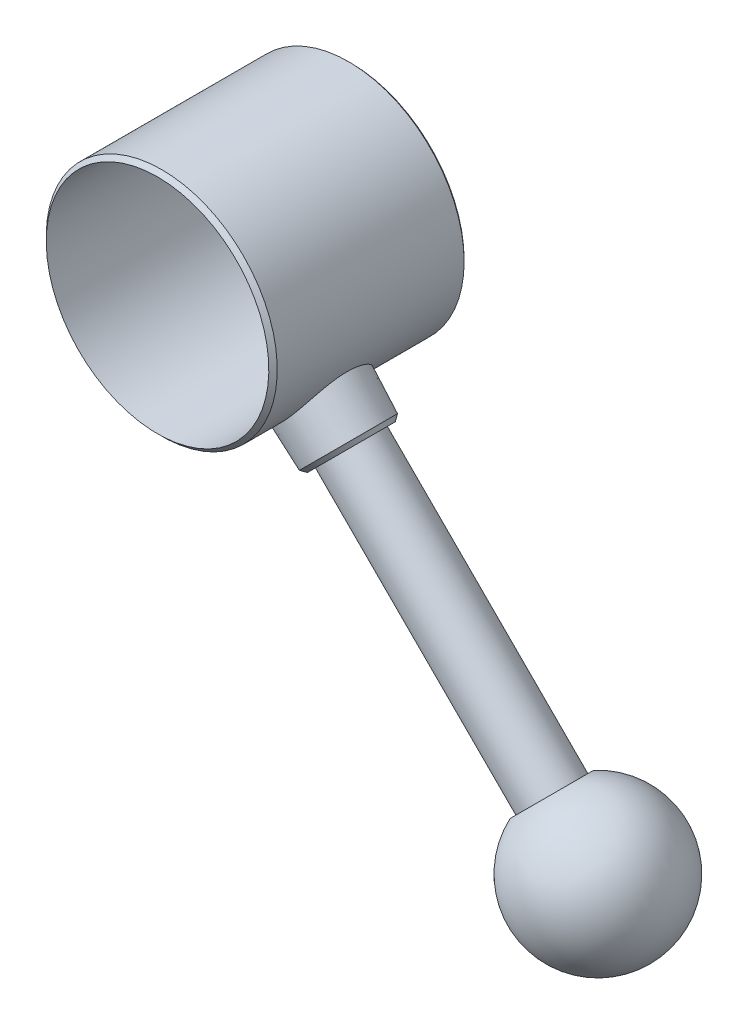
ISO-10303-21;
HEADER;
FILE_DESCRIPTION(('STEP AP214'),'2;1');
FILE_NAME('part.step','',(''),(''),'','','');
FILE_SCHEMA(('AUTOMOTIVE_DESIGN { 1 0 10303 214 1 1 1 1 }'));
ENDSEC;
DATA;
#1=APPLICATION_CONTEXT('core data for automotive mechanical design processes');
#2=APPLICATION_PROTOCOL_DEFINITION('international standard','automotive_design',2000,#1);
#3=PRODUCT_CONTEXT('',#1,'mechanical');
#4=PRODUCT('Part','Part','',(#3));
#5=PRODUCT_RELATED_PRODUCT_CATEGORY('part','',(#4));
#6=PRODUCT_DEFINITION_FORMATION('','',#4);
#7=PRODUCT_DEFINITION_CONTEXT('part definition',#1,'design');
#8=PRODUCT_DEFINITION('design','',#6,#7);
#9=PRODUCT_DEFINITION_SHAPE('','',#8);
#10=(LENGTH_UNIT() NAMED_UNIT(*) SI_UNIT(.MILLI.,.METRE.));
#11=(NAMED_UNIT(*) PLANE_ANGLE_UNIT() SI_UNIT($,.RADIAN.));
#12=(NAMED_UNIT(*) SI_UNIT($,.STERADIAN.) SOLID_ANGLE_UNIT());
#13=UNCERTAINTY_MEASURE_WITH_UNIT(LENGTH_MEASURE(1.E-05),#10,'distance_accuracy_value','');
#14=(GEOMETRIC_REPRESENTATION_CONTEXT(3) GLOBAL_UNCERTAINTY_ASSIGNED_CONTEXT((#13)) GLOBAL_UNIT_ASSIGNED_CONTEXT((#10,
#11,#12)) REPRESENTATION_CONTEXT('',''));
#15=CARTESIAN_POINT('',(0.,0.,0.));
#16=DIRECTION('',(0.,0.,1.));
#17=DIRECTION('',(1.,0.,0.));
#18=AXIS2_PLACEMENT_3D('',#15,#16,#17);
#19=CARTESIAN_POINT('',(84.8528137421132,-84.8528137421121,25.9999999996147));
#20=DIRECTION('',(-0.707106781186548,0.707106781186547,0.));
#21=DIRECTION('',(0.,0.,1.));
#22=AXIS2_PLACEMENT_3D('',#19,#20,#21);
#23=SPHERICAL_SURFACE('',#22,17.5);
#24=CARTESIAN_POINT('',(97.2271824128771,-97.2271824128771,26.0000001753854));
#25=VERTEX_POINT('',#24);
#26=VERTEX_LOOP('',#25);
#27=FACE_BOUND('',#26,.T.);
#28=CARTESIAN_POINT('',(73.8926586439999,-73.8926586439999,26.));
#29=DIRECTION('',(-0.707106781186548,0.707106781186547,0.));
#30=DIRECTION('',(-0.707106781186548,-0.707106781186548,0.));
#31=AXIS2_PLACEMENT_3D('',#28,#29,#30);
#32=CIRCLE('',#31,8.12403843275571);
#33=CARTESIAN_POINT('',(68.1480959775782,-79.6372213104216,26.));
#34=VERTEX_POINT('',#33);
#35=EDGE_CURVE('E18',#34,#34,#32,.T.);
#36=ORIENTED_EDGE('',*,*,#35,.F.);
#37=EDGE_LOOP('',(#36));
#38=FACE_BOUND('',#37,.T.);
#39=ADVANCED_FACE('F14',(#27,#38),#23,.T.);
#40=CARTESIAN_POINT('',(68.079161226,-79.706156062,34.2215268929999));
#41=DIRECTION('',(-0.707106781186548,0.707106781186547,0.));
#42=DIRECTION('',(0.707106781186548,0.707106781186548,0.));
#43=AXIS2_PLACEMENT_3D('',#40,#41,#42);
#44=PLANE('',#43);
#45=CARTESIAN_POINT('',(73.8926586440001,-73.8926586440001,26.));
#46=DIRECTION('',(-0.707106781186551,0.707106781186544,0.));
#47=DIRECTION('',(-0.707106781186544,-0.707106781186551,0.));
#48=AXIS2_PLACEMENT_3D('',#45,#46,#47);
#49=CIRCLE('',#48,6.99999999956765);
#50=CARTESIAN_POINT('',(68.942911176,-78.8424061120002,26.));
#51=VERTEX_POINT('',#50);
#52=EDGE_CURVE('E34',#51,#51,#49,.F.);
#53=ORIENTED_EDGE('',*,*,#52,.T.);
#54=EDGE_LOOP('',(#53));
#55=FACE_BOUND('',#54,.T.);
#56=ORIENTED_EDGE('',*,*,#35,.T.);
#57=EDGE_LOOP('',(#56));
#58=FACE_BOUND('',#57,.T.);
#59=ADVANCED_FACE('F28',(#55,#58),#44,.T.);
#60=CARTESIAN_POINT('',(73.8926586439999,-73.8926586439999,26.));
#61=DIRECTION('',(-0.707106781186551,0.707106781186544,0.));
#62=DIRECTION('',(-0.707106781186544,-0.707106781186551,0.));
#63=AXIS2_PLACEMENT_3D('',#60,#61,#62);
#64=CYLINDRICAL_SURFACE('',#63,6.99999999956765);
#65=ORIENTED_EDGE('',*,*,#52,.F.);
#66=EDGE_LOOP('',(#65));
#67=FACE_BOUND('',#66,.T.);
#68=CARTESIAN_POINT('',(26.1629509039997,-26.1629509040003,26.));
#69=DIRECTION('',(-0.707106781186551,0.707106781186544,0.));
#70=DIRECTION('',(-0.707106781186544,-0.707106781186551,0.));
#71=AXIS2_PLACEMENT_3D('',#68,#69,#70);
#72=CIRCLE('',#71,6.99999999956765);
#73=CARTESIAN_POINT('',(21.2132034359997,-31.1126983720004,26.));
#74=VERTEX_POINT('',#73);
#75=EDGE_CURVE('E37',#74,#74,#72,.T.);
#76=ORIENTED_EDGE('',*,*,#75,.F.);
#77=EDGE_LOOP('',(#76));
#78=FACE_BOUND('',#77,.T.);
#79=ADVANCED_FACE('F51',(#67,#78),#64,.T.);
#80=CARTESIAN_POINT('',(32.274691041,-20.0512107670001,34.643305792));
#81=DIRECTION('',(0.707106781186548,-0.707106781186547,0.));
#82=DIRECTION('',(-0.707106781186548,-0.707106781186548,0.));
#83=AXIS2_PLACEMENT_3D('',#80,#81,#82);
#84=PLANE('',#83);
#85=ORIENTED_EDGE('',*,*,#75,.T.);
#86=EDGE_LOOP('',(#85));
#87=FACE_BOUND('',#86,.T.);
#88=CARTESIAN_POINT('',(26.1629509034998,-26.1629509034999,26.));
#89=DIRECTION('',(-0.707106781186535,0.70710678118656,0.));
#90=DIRECTION('',(-0.70710678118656,-0.707106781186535,0.));
#91=AXIS2_PLACEMENT_3D('',#88,#89,#90);
#92=CIRCLE('',#91,8.54081600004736);
#93=CARTESIAN_POINT('',(20.1236819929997,-32.2022198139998,26.));
#94=VERTEX_POINT('',#93);
#95=EDGE_CURVE('E77',#94,#94,#92,.F.);
#96=ORIENTED_EDGE('',*,*,#95,.T.);
#97=EDGE_LOOP('',(#96));
#98=FACE_BOUND('',#97,.T.);
#99=ADVANCED_FACE('F54',(#87,#98),#84,.T.);
#100=CARTESIAN_POINT('',(26.1629509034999,-26.1629509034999,26.));
#101=DIRECTION('',(-0.707106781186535,0.70710678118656,0.));
#102=DIRECTION('',(-0.70710678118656,-0.707106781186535,0.));
#103=AXIS2_PLACEMENT_3D('',#100,#101,#102);
#104=CONICAL_SURFACE('',#103,8.54081600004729,0.785398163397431);
#105=ORIENTED_EDGE('',*,*,#95,.F.);
#106=EDGE_LOOP('',(#105));
#107=FACE_BOUND('',#106,.T.);
#108=CARTESIAN_POINT('',(25.4558441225,-25.4558441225,26.));
#109=DIRECTION('',(-0.707106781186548,0.707106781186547,0.));
#110=DIRECTION('',(0.707106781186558,0.707106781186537,0.));
#111=AXIS2_PLACEMENT_3D('',#108,#109,#110);
#112=CIRCLE('',#111,9.54081599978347);
#113=CARTESIAN_POINT('',(32.2022198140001,-18.709468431,26.));
#114=VERTEX_POINT('',#113);
#115=EDGE_CURVE('E75',#114,#114,#112,.F.);
#116=ORIENTED_EDGE('',*,*,#115,.T.);
#117=EDGE_LOOP('',(#116));
#118=FACE_BOUND('',#117,.T.);
#119=ADVANCED_FACE('F56',(#107,#118),#104,.T.);
#120=CARTESIAN_POINT('',(25.4558441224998,-25.4558441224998,26.));
#121=DIRECTION('',(-0.707106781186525,0.70710678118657,0.));
#122=DIRECTION('',(-0.70710678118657,-0.707106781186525,0.));
#123=AXIS2_PLACEMENT_3D('',#120,#121,#122);
#124=CONICAL_SURFACE('',#123,9.54081599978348,0.0407937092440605);
#125=ORIENTED_EDGE('',*,*,#115,.F.);
#126=EDGE_LOOP('',(#125));
#127=FACE_BOUND('',#126,.T.);
#128=CARTESIAN_POINT('',(25.1697599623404,-11.0785009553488,26.0000000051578));
#129=CARTESIAN_POINT('',(25.1697600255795,-11.0785003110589,26.2654053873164));
#130=CARTESIAN_POINT('',(25.1651041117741,-11.0890968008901,26.530804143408));
#131=CARTESIAN_POINT('',(25.1464619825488,-11.1313063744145,27.0596893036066));
#132=CARTESIAN_POINT('',(25.1324724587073,-11.1629269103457,27.3231749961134));
#133=CARTESIAN_POINT('',(25.0950881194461,-11.2467174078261,27.8465436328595));
#134=CARTESIAN_POINT('',(25.071680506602,-11.2989153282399,28.1064211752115));
#135=CARTESIAN_POINT('',(25.0153809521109,-11.4230184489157,28.620384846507));
#136=CARTESIAN_POINT('',(24.9824884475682,-11.4949248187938,28.8744706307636));
#137=CARTESIAN_POINT('',(24.9072305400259,-11.6570932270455,29.3743627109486));
#138=CARTESIAN_POINT('',(24.8648951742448,-11.7472969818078,29.6201924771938));
#139=CARTESIAN_POINT('',(24.7705586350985,-11.9449322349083,30.1029023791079));
#140=CARTESIAN_POINT('',(24.7185572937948,-12.0523640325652,30.3397823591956));
#141=CARTESIAN_POINT('',(24.6047477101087,-12.283033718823,30.8031748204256));
#142=CARTESIAN_POINT('',(24.5429420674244,-12.4062674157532,31.0296900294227));
#143=CARTESIAN_POINT('',(24.4093199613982,-12.6671456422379,31.4712812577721));
#144=CARTESIAN_POINT('',(24.3374998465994,-12.8047954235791,31.6863530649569));
#145=CARTESIAN_POINT('',(24.1800706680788,-13.0997487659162,32.1136848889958));
#146=CARTESIAN_POINT('',(24.0939719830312,-13.257672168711,32.325337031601));
#147=CARTESIAN_POINT('',(23.9104386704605,-13.5858849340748,32.7336069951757));
#148=CARTESIAN_POINT('',(23.8130036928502,-13.75617467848,32.9302243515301));
#149=CARTESIAN_POINT('',(23.6066003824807,-14.1074422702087,33.3073931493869));
#150=CARTESIAN_POINT('',(23.4976265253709,-14.2884252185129,33.4879368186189));
#151=CARTESIAN_POINT('',(23.2681535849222,-14.6591448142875,33.8316954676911));
#152=CARTESIAN_POINT('',(23.1476595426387,-14.8488776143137,33.9949179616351));
#153=CARTESIAN_POINT('',(22.8900412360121,-15.2431510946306,34.3092760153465));
#154=CARTESIAN_POINT('',(22.7524433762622,-15.4479804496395,34.4596626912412));
#155=CARTESIAN_POINT('',(22.464971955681,-15.8631254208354,34.7394635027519));
#156=CARTESIAN_POINT('',(22.3151032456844,-16.0734388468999,34.8688858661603));
#157=CARTESIAN_POINT('',(22.0034028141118,-16.4975608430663,35.1057629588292));
#158=CARTESIAN_POINT('',(21.8415710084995,-16.7113694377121,35.2132175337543));
#159=CARTESIAN_POINT('',(21.506543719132,-17.1403801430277,35.4051825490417));
#160=CARTESIAN_POINT('',(21.3333487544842,-17.3555821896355,35.4896940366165));
#161=CARTESIAN_POINT('',(20.9824433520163,-17.7780744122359,35.632511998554));
#162=CARTESIAN_POINT('',(20.8050798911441,-17.9853875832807,35.6916032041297));
#163=CARTESIAN_POINT('',(20.4415442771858,-18.3975204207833,35.7870184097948));
#164=CARTESIAN_POINT('',(20.2553722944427,-18.6023401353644,35.8233428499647));
#165=CARTESIAN_POINT('',(19.875508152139,-19.0076643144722,35.8728504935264));
#166=CARTESIAN_POINT('',(19.6818178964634,-19.2081698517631,35.8860395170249));
#167=CARTESIAN_POINT('',(19.2883248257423,-19.6032714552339,35.8891567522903));
#168=CARTESIAN_POINT('',(19.0885221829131,-19.797867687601,35.8790856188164));
#169=CARTESIAN_POINT('',(18.6933999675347,-20.1712017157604,35.8367518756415));
#170=CARTESIAN_POINT('',(18.4982746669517,-20.3502600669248,35.8054934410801));
#171=CARTESIAN_POINT('',(18.1054594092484,-20.7005213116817,35.7221261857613));
#172=CARTESIAN_POINT('',(17.907769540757,-20.8717244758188,35.6700180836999));
#173=CARTESIAN_POINT('',(17.5114155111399,-21.2053634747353,35.5454157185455));
#174=CARTESIAN_POINT('',(17.3127513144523,-21.3677989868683,35.4729207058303));
#175=CARTESIAN_POINT('',(16.9160900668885,-21.6831756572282,35.3081586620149));
#176=CARTESIAN_POINT('',(16.7180930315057,-21.83611659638,35.2158911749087));
#177=CARTESIAN_POINT('',(16.3220564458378,-22.13374275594,35.0110932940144));
#178=CARTESIAN_POINT('',(16.1240448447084,-22.2783070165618,34.8983332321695));
#179=CARTESIAN_POINT('',(15.7320249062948,-22.5568445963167,34.6541121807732));
#180=CARTESIAN_POINT('',(15.5380180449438,-22.6908140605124,34.522644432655));
#181=CARTESIAN_POINT('',(15.1557565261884,-22.9478997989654,34.2419394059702));
#182=CARTESIAN_POINT('',(14.967501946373,-23.0710159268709,34.0927018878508));
#183=CARTESIAN_POINT('',(14.5983954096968,-23.3063245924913,33.7773945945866));
#184=CARTESIAN_POINT('',(14.4175439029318,-23.4185164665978,33.6113237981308));
#185=CARTESIAN_POINT('',(14.0558916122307,-23.6374457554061,33.2544461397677));
#186=CARTESIAN_POINT('',(13.8755636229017,-23.7436133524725,33.0628097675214));
#187=CARTESIAN_POINT('',(13.526785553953,-23.9440292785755,32.6631841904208));
#188=CARTESIAN_POINT('',(13.3583358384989,-24.0382772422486,32.4551944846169));
#189=CARTESIAN_POINT('',(13.035100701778,-24.2150802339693,32.0239667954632));
#190=CARTESIAN_POINT('',(12.8803227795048,-24.2976288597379,31.800720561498));
#191=CARTESIAN_POINT('',(12.5864015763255,-24.451175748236,31.3404016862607));
#192=CARTESIAN_POINT('',(12.4472574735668,-24.5221746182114,31.1033297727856));
#193=CARTESIAN_POINT('',(12.1844951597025,-24.6538029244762,30.6131937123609));
#194=CARTESIAN_POINT('',(12.0611354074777,-24.7142644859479,30.3599456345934));
#195=CARTESIAN_POINT('',(11.8342528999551,-24.8237049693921,29.8424478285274));
#196=CARTESIAN_POINT('',(11.7307215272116,-24.8726888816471,29.5782029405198));
#197=CARTESIAN_POINT('',(11.5452610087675,-24.9593152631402,29.0409328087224));
#198=CARTESIAN_POINT('',(11.4632956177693,-24.9969767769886,28.7679231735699));
#199=CARTESIAN_POINT('',(11.3222070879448,-25.0611980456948,28.2149076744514));
#200=CARTESIAN_POINT('',(11.263073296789,-25.0877629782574,27.9349051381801));
#201=CARTESIAN_POINT('',(11.1703728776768,-25.1291713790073,27.380089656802));
#202=CARTESIAN_POINT('',(11.1359751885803,-25.1443965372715,27.1054439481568));
#203=CARTESIAN_POINT('',(11.0900395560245,-25.1646907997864,26.5538630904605));
#204=CARTESIAN_POINT('',(11.0785016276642,-25.1697598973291,26.2769279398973));
#205=CARTESIAN_POINT('',(11.0785003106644,-25.1697600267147,25.7345946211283));
#206=CARTESIAN_POINT('',(11.0890968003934,-25.1651041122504,25.469195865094));
#207=CARTESIAN_POINT('',(11.1313063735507,-25.1464619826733,24.9403107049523));
#208=CARTESIAN_POINT('',(11.1629269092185,-25.1324724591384,24.6768250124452));
#209=CARTESIAN_POINT('',(11.2467174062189,-25.0950881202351,24.1534563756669));
#210=CARTESIAN_POINT('',(11.2989153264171,-25.0716805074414,23.8935788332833));
#211=CARTESIAN_POINT('',(11.4230184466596,-25.015380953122,23.3796151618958));
#212=CARTESIAN_POINT('',(11.4949248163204,-24.9824884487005,23.1255293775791));
#213=CARTESIAN_POINT('',(11.6570932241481,-24.907230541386,22.62563729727));
#214=CARTESIAN_POINT('',(11.7472969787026,-24.8648951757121,22.3798075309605));
#215=CARTESIAN_POINT('',(11.9449322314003,-24.7705586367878,21.897097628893));
#216=CARTESIAN_POINT('',(12.0523640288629,-24.7185572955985,21.6602176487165));
#217=CARTESIAN_POINT('',(12.2830337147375,-24.6047477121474,21.1968251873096));
#218=CARTESIAN_POINT('',(12.4062674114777,-24.5429420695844,20.9703099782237));
#219=CARTESIAN_POINT('',(12.6671456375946,-24.4093199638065,20.5287187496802));
#220=CARTESIAN_POINT('',(12.804795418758,-24.3374998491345,20.31364694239));
#221=CARTESIAN_POINT('',(13.0997487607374,-24.1800706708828,19.8863151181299));
#222=CARTESIAN_POINT('',(13.2576721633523,-24.0939719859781,19.6746629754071));
#223=CARTESIAN_POINT('',(13.5858849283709,-23.9104386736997,19.2663930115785));
#224=CARTESIAN_POINT('',(13.7561746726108,-23.8130036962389,19.0697756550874));
#225=CARTESIAN_POINT('',(14.1074422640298,-23.6066003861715,18.692606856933));
#226=CARTESIAN_POINT('',(14.2884252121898,-23.497626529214,18.5120631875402));
#227=CARTESIAN_POINT('',(14.6591448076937,-23.2681535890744,18.1683045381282));
#228=CARTESIAN_POINT('',(14.8488776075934,-23.1476595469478,18.0050820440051));
#229=CARTESIAN_POINT('',(15.2431510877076,-22.8900412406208,17.6907239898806));
#230=CARTESIAN_POINT('',(15.4479804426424,-22.7524433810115,17.5403373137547));
#231=CARTESIAN_POINT('',(15.8631254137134,-22.4649719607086,17.2605365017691));
#232=CARTESIAN_POINT('',(16.0734388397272,-22.3151032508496,17.1311141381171));
#233=CARTESIAN_POINT('',(16.4975608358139,-22.0034028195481,16.8942370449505));
#234=CARTESIAN_POINT('',(16.7113694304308,-21.8415710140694,16.7867824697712));
#235=CARTESIAN_POINT('',(17.140380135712,-21.5065437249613,16.5948174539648));
#236=CARTESIAN_POINT('',(17.3555821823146,-21.3333487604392,16.5103059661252));
#237=CARTESIAN_POINT('',(17.7780744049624,-20.9824433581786,16.3674880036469));
#238=CARTESIAN_POINT('',(17.9853875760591,-20.805079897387,16.3083967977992));
#239=CARTESIAN_POINT('',(18.3975204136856,-20.4415442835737,16.2129815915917));
#240=CARTESIAN_POINT('',(18.6023401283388,-20.2553723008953,16.1766571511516));
#241=CARTESIAN_POINT('',(19.0076643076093,-19.8755081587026,16.1271495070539));
#242=CARTESIAN_POINT('',(19.2081698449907,-19.6818179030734,16.1139604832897));
#243=CARTESIAN_POINT('',(19.6032714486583,-19.2883248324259,16.1108432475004));
#244=CARTESIAN_POINT('',(19.7978676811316,-19.0885221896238,16.120914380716));
#245=CARTESIAN_POINT('',(20.1712017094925,-18.6933999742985,16.1632481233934));
#246=CARTESIAN_POINT('',(20.3502600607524,-18.4982746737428,16.194506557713));
#247=CARTESIAN_POINT('',(20.700521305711,-18.1054594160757,16.2778738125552));
#248=CARTESIAN_POINT('',(20.8717244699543,-17.9077695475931,16.3299819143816));
#249=CARTESIAN_POINT('',(21.2053634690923,-17.5114155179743,16.4545842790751));
#250=CARTESIAN_POINT('',(21.3677989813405,-17.3127513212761,16.5270792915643));
#251=CARTESIAN_POINT('',(21.6831756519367,-16.9160900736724,16.6918413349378));
#252=CARTESIAN_POINT('',(21.8361165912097,-16.7180930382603,16.7841088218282));
#253=CARTESIAN_POINT('',(22.1337427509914,-16.3220564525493,16.9889067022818));
#254=CARTESIAN_POINT('',(22.2783070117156,-16.1240448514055,17.1016667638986));
#255=CARTESIAN_POINT('',(22.5568445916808,-15.732024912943,17.3458878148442));
#256=CARTESIAN_POINT('',(22.6908140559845,-15.5380180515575,17.4773555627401));
#257=CARTESIAN_POINT('',(22.9478997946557,-15.1557565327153,17.7580605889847));
#258=CARTESIAN_POINT('',(23.0710159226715,-14.9675019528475,17.9072981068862));
#259=CARTESIAN_POINT('',(23.3063245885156,-14.5983954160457,18.2226053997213));
#260=CARTESIAN_POINT('',(23.4185164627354,-14.4175439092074,18.388676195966));
#261=CARTESIAN_POINT('',(23.6374457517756,-14.0558916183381,18.7455538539));
#262=CARTESIAN_POINT('',(23.7436133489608,-13.8755636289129,18.9371902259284));
#263=CARTESIAN_POINT('',(23.9440292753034,-13.5267855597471,19.3368158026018));
#264=CARTESIAN_POINT('',(24.0382772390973,-13.3583358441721,19.5448055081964));
#265=CARTESIAN_POINT('',(24.2150802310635,-13.0351007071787,19.9760331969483));
#266=CARTESIAN_POINT('',(24.2976288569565,-12.8803227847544,20.1992794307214));
#267=CARTESIAN_POINT('',(24.4511757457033,-12.5864015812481,20.6595983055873));
#268=CARTESIAN_POINT('',(24.522174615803,-12.4472574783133,20.8966702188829));
#269=CARTESIAN_POINT('',(24.6538029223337,-12.1844951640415,21.3868062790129));
#270=CARTESIAN_POINT('',(24.7142644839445,-12.0611354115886,21.640054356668));
#271=CARTESIAN_POINT('',(24.8237049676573,-11.8342529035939,22.1575521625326));
#272=CARTESIAN_POINT('',(24.8726888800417,-11.7307215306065,22.4217970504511));
#273=CARTESIAN_POINT('',(24.9593152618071,-11.5452610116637,22.9590671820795));
#274=CARTESIAN_POINT('',(24.9969767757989,-11.4632956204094,23.2320768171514));
#275=CARTESIAN_POINT('',(25.061198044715,-11.3222070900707,23.7850923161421));
#276=CARTESIAN_POINT('',(25.0877629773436,-11.2630732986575,24.0650948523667));
#277=CARTESIAN_POINT('',(25.1291713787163,-11.1703728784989,24.6199103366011));
#278=CARTESIAN_POINT('',(25.144396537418,-11.1359751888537,24.8945560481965));
#279=CARTESIAN_POINT('',(25.1646907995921,-11.0900395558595,25.4461369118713));
#280=CARTESIAN_POINT('',(25.1697598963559,-11.0785016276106,25.723072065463));
#281=CARTESIAN_POINT('',(25.1697599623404,-11.0785009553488,26.0000000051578));
#282=B_SPLINE_CURVE_WITH_KNOTS('',3,(#128,#129,#130,#131,#132,#133,#134,#135,#136,#137,#138,
#139,#140,#141,#142,#143,#144,#145,#146,#147,#148,#149,#150,#151,#152,#153,#154,#155,#156,#157,
#158,#159,#160,#161,#162,#163,#164,#165,#166,#167,#168,#169,#170,#171,#172,#173,#174,#175,#176,
#177,#178,#179,#180,#181,#182,#183,#184,#185,#186,#187,#188,#189,#190,#191,#192,#193,#194,#195,
#196,#197,#198,#199,#200,#201,#202,#203,#204,#205,#206,#207,#208,#209,#210,#211,#212,#213,#214,
#215,#216,#217,#218,#219,#220,#221,#222,#223,#224,#225,#226,#227,#228,#229,#230,#231,#232,#233,
#234,#235,#236,#237,#238,#239,#240,#241,#242,#243,#244,#245,#246,#247,#248,#249,#250,#251,#252,
#253,#254,#255,#256,#257,#258,#259,#260,#261,#262,#263,#264,#265,#266,#267,#268,#269,#270,#271,
#272,#273,#274,#275,#276,#277,#278,#279,#280,#281),.UNSPECIFIED.,.T.,.F.,(4,2,2,2,2,2,2,2,2,2,2,
2,2,2,2,2,2,2,2,2,2,2,2,2,2,2,2,2,2,2,2,2,2,2,2,2,2,2,2,2,2,2,2,2,2,2,2,2,2,2,2,2,2,2,2,2,2,2,2,
2,2,2,2,2,2,2,2,2,2,2,2,2,2,2,2,2,4),(0.,0.795954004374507,1.59219029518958,2.38951219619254,
3.18688142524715,3.98174955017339,4.77663148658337,5.57130300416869,6.36626503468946,
7.1986119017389,8.03098448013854,8.86375738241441,9.69616752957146,10.562014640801,
11.4275211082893,12.2930336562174,13.1585066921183,13.9949144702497,14.8313060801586,
15.6674872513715,16.5036448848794,17.3027126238,18.1017528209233,18.9008224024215,
19.6999104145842,20.5085786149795,21.3175397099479,22.1265117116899,22.935532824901,
23.7858058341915,24.6361048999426,25.4868674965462,26.3375853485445,27.2008157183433,
28.0636700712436,28.9250648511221,29.7860572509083,30.616566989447,31.4470772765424,
32.2430312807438,33.0392675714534,33.8365894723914,34.6339587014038,35.428826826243,
36.2237087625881,37.0183802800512,37.8133423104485,38.6456891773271,39.478061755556,
40.3108346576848,41.143244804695,42.0090919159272,42.8745983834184,43.7401109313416,
44.6055839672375,45.4419917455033,46.278383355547,47.1145645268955,47.9507221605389,
48.7497898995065,49.5488300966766,50.3478996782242,51.1469876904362,51.9556558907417,
52.7646169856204,53.5735889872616,54.3826101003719,55.232883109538,56.0831821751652,
56.9339447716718,57.7846626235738,58.6478929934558,59.5107473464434,60.3721421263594,
61.2331345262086,62.063644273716,62.8941545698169),.UNSPECIFIED.);
#283=CARTESIAN_POINT('',(25.1697599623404,-11.0785009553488,26.0000000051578));
#284=VERTEX_POINT('',#283);
#285=EDGE_CURVE('E68',#284,#284,#282,.T.);
#286=ORIENTED_EDGE('',*,*,#285,.T.);
#287=EDGE_LOOP('',(#286));
#288=FACE_BOUND('',#287,.T.);
#289=ADVANCED_FACE('F59',(#127,#288),#124,.T.);
#290=CARTESIAN_POINT('',(0.,0.,46.5));
#291=DIRECTION('',(0.,0.,-1.));
#292=DIRECTION('',(-1.,0.,0.));
#293=AXIS2_PLACEMENT_3D('',#290,#291,#292);
#294=CONICAL_SURFACE('',#293,26.0000000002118,0.78539816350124);
#295=CARTESIAN_POINT('',(0.,0.,46.0000000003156));
#296=DIRECTION('',(0.,0.,-1.));
#297=DIRECTION('',(0.,1.,0.));
#298=AXIS2_PLACEMENT_3D('',#295,#296,#297);
#299=CIRCLE('',#298,26.5);
#300=CARTESIAN_POINT('',(0.,26.4999999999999,46.0000000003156));
#301=VERTEX_POINT('',#300);
#302=EDGE_CURVE('E35',#301,#301,#299,.T.);
#303=ORIENTED_EDGE('',*,*,#302,.T.);
#304=EDGE_LOOP('',(#303));
#305=FACE_BOUND('',#304,.T.);
#306=CARTESIAN_POINT('',(0.,0.,45.));
#307=DIRECTION('',(0.,0.,-1.));
#308=DIRECTION('',(0.707106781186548,0.707106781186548,0.));
#309=AXIS2_PLACEMENT_3D('',#306,#307,#308);
#310=CIRCLE('',#309,27.5000000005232);
#311=CARTESIAN_POINT('',(19.445436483,19.4454364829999,45.));
#312=VERTEX_POINT('',#311);
#313=EDGE_CURVE('E74',#312,#312,#310,.F.);
#314=ORIENTED_EDGE('',*,*,#313,.T.);
#315=EDGE_LOOP('',(#314));
#316=FACE_BOUND('',#315,.T.);
#317=ADVANCED_FACE('F64',(#305,#316),#294,.T.);
#318=CARTESIAN_POINT('',(0.,0.,45.));
#319=DIRECTION('',(0.,0.,-1.));
#320=DIRECTION('',(-1.,0.,0.));
#321=AXIS2_PLACEMENT_3D('',#318,#319,#320);
#322=CYLINDRICAL_SURFACE('',#321,27.5000000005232);
#323=ORIENTED_EDGE('',*,*,#313,.F.);
#324=EDGE_LOOP('',(#323));
#325=FACE_BOUND('',#324,.T.);
#326=CARTESIAN_POINT('',(0.,0.,0.499999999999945));
#327=DIRECTION('',(0.,0.,1.));
#328=DIRECTION('',(-0.707106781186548,-0.707106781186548,0.));
#329=AXIS2_PLACEMENT_3D('',#326,#327,#328);
#330=CIRCLE('',#329,27.5000000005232);
#331=CARTESIAN_POINT('',(-19.445436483,-19.445436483,0.49999999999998));
#332=VERTEX_POINT('',#331);
#333=EDGE_CURVE('E22',#332,#332,#330,.T.);
#334=ORIENTED_EDGE('',*,*,#333,.T.);
#335=EDGE_LOOP('',(#334));
#336=FACE_BOUND('',#335,.T.);
#337=ORIENTED_EDGE('',*,*,#285,.F.);
#338=EDGE_LOOP('',(#337));
#339=FACE_BOUND('',#338,.T.);
#340=ADVANCED_FACE('F79',(#325,#336,#339),#322,.T.);
#341=CARTESIAN_POINT('',(0.,0.,0.));
#342=DIRECTION('',(0.,0.,1.));
#343=DIRECTION('',(1.,0.,0.));
#344=AXIS2_PLACEMENT_3D('',#341,#342,#343);
#345=CONICAL_SURFACE('',#344,26.999999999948,0.785398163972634);
#346=CARTESIAN_POINT('',(0.,0.,0.));
#347=DIRECTION('',(0.,0.,1.));
#348=DIRECTION('',(1.,0.,0.));
#349=AXIS2_PLACEMENT_3D('',#346,#347,#348);
#350=CIRCLE('',#349,26.999999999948);
#351=CARTESIAN_POINT('',(26.999999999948,0.,0.));
#352=VERTEX_POINT('',#351);
#353=EDGE_CURVE('E9',#352,#352,#350,.T.);
#354=ORIENTED_EDGE('',*,*,#353,.T.);
#355=EDGE_LOOP('',(#354));
#356=FACE_BOUND('',#355,.T.);
#357=ORIENTED_EDGE('',*,*,#333,.F.);
#358=EDGE_LOOP('',(#357));
#359=FACE_BOUND('',#358,.T.);
#360=ADVANCED_FACE('F83',(#356,#359),#345,.T.);
#361=CARTESIAN_POINT('',(0.,38.641971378,0.));
#362=DIRECTION('',(0.,0.,1.));
#363=DIRECTION('',(-0.707106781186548,-0.707106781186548,0.));
#364=AXIS2_PLACEMENT_3D('',#361,#362,#363);
#365=PLANE('',#364);
#366=CARTESIAN_POINT('',(0.,0.,0.));
#367=DIRECTION('',(0.,0.,-1.));
#368=DIRECTION('',(0.,1.,0.));
#369=AXIS2_PLACEMENT_3D('',#366,#367,#368);
#370=CIRCLE('',#369,26.5);
#371=CARTESIAN_POINT('',(0.,26.5,0.));
#372=VERTEX_POINT('',#371);
#373=EDGE_CURVE('E39',#372,#372,#370,.T.);
#374=ORIENTED_EDGE('',*,*,#373,.F.);
#375=EDGE_LOOP('',(#374));
#376=FACE_BOUND('',#375,.T.);
#377=ORIENTED_EDGE('',*,*,#353,.F.);
#378=EDGE_LOOP('',(#377));
#379=FACE_BOUND('',#378,.T.);
#380=ADVANCED_FACE('F16',(#376,#379),#365,.F.);
#381=CARTESIAN_POINT('',(0.,0.,66.5));
#382=DIRECTION('',(0.,0.,-1.));
#383=DIRECTION('',(0.,1.,0.));
#384=AXIS2_PLACEMENT_3D('',#381,#382,#383);
#385=CYLINDRICAL_SURFACE('',#384,26.5);
#386=ORIENTED_EDGE('',*,*,#373,.T.);
#387=EDGE_LOOP('',(#386));
#388=FACE_BOUND('',#387,.T.);
#389=ORIENTED_EDGE('',*,*,#302,.F.);
#390=EDGE_LOOP('',(#389));
#391=FACE_BOUND('',#390,.T.);
#392=ADVANCED_FACE('F30',(#388,#391),#385,.F.);
#393=CLOSED_SHELL('',(#39,#59,#79,#99,#119,#289,#317,#340,#360,#380,#392));
#394=MANIFOLD_SOLID_BREP('B1',#393);
#395=ADVANCED_BREP_SHAPE_REPRESENTATION('',(#18,#394),#14);
#396=SHAPE_DEFINITION_REPRESENTATION(#9,#395);
ENDSEC;
END-ISO-10303-21;
